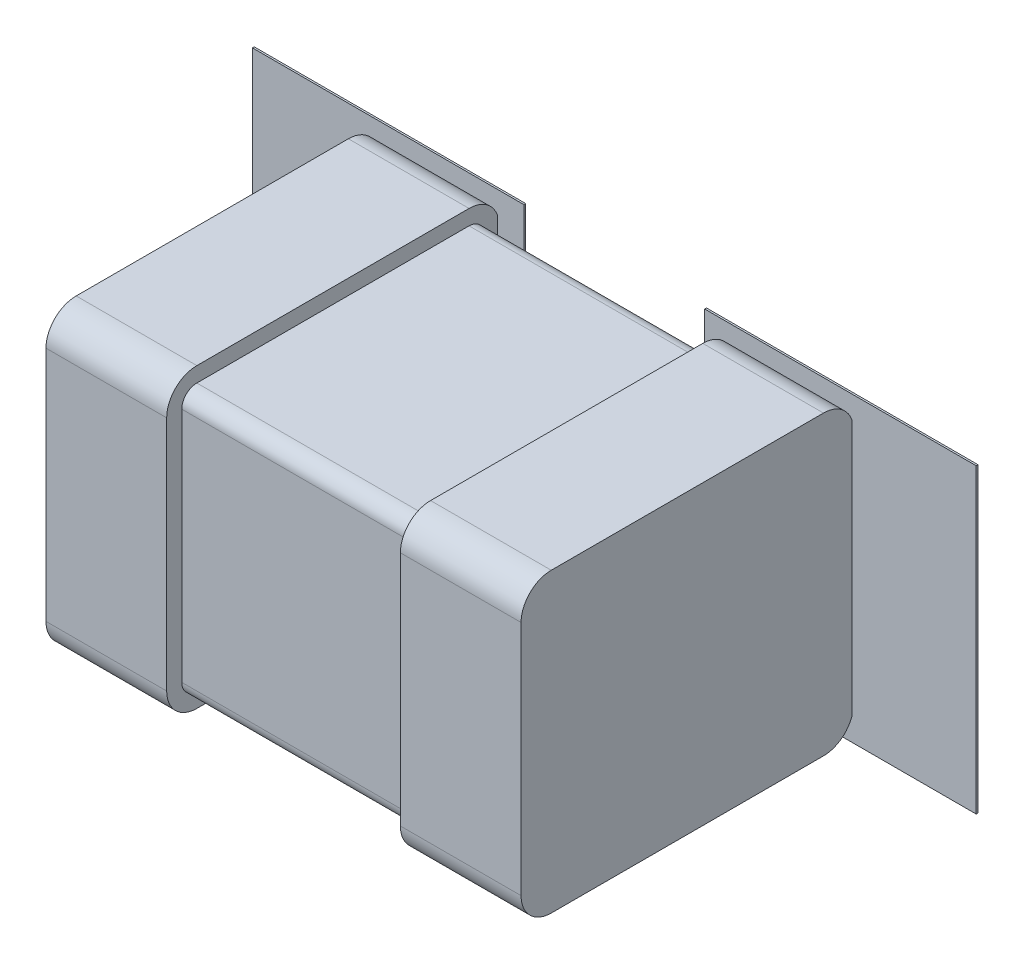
ISO-10303-21;
HEADER;
FILE_DESCRIPTION(('STEP AP214'),'2;1');
FILE_NAME('part.step','',(''),(''),'','','');
FILE_SCHEMA(('AUTOMOTIVE_DESIGN { 1 0 10303 214 1 1 1 1 }'));
ENDSEC;
DATA;
#1=APPLICATION_CONTEXT('core data for automotive mechanical design processes');
#2=APPLICATION_PROTOCOL_DEFINITION('international standard','automotive_design',2000,#1);
#3=PRODUCT_CONTEXT('',#1,'mechanical');
#4=PRODUCT('Part','Part','',(#3));
#5=PRODUCT_RELATED_PRODUCT_CATEGORY('part','',(#4));
#6=PRODUCT_DEFINITION_FORMATION('','',#4);
#7=PRODUCT_DEFINITION_CONTEXT('part definition',#1,'design');
#8=PRODUCT_DEFINITION('design','',#6,#7);
#9=PRODUCT_DEFINITION_SHAPE('','',#8);
#10=(LENGTH_UNIT() NAMED_UNIT(*) SI_UNIT(.MILLI.,.METRE.));
#11=(NAMED_UNIT(*) PLANE_ANGLE_UNIT() SI_UNIT($,.RADIAN.));
#12=(NAMED_UNIT(*) SI_UNIT($,.STERADIAN.) SOLID_ANGLE_UNIT());
#13=UNCERTAINTY_MEASURE_WITH_UNIT(LENGTH_MEASURE(1.E-05),#10,'distance_accuracy_value','');
#14=(GEOMETRIC_REPRESENTATION_CONTEXT(3) GLOBAL_UNCERTAINTY_ASSIGNED_CONTEXT((#13)) GLOBAL_UNIT_ASSIGNED_CONTEXT((#10,
#11,#12)) REPRESENTATION_CONTEXT('',''));
#15=CARTESIAN_POINT('',(0.,0.,0.));
#16=DIRECTION('',(0.,0.,1.));
#17=DIRECTION('',(1.,0.,0.));
#18=AXIS2_PLACEMENT_3D('',#15,#16,#17);
#19=CARTESIAN_POINT('',(0.,0.,0.0762));
#20=DIRECTION('',(0.,0.,1.));
#21=DIRECTION('',(1.,0.,0.));
#22=AXIS2_PLACEMENT_3D('',#19,#20,#21);
#23=PLANE('',#22);
#24=DIRECTION('',(0.,1.,0.));
#25=VECTOR('',#24,1.);
#26=CARTESIAN_POINT('',(0.380492,0.635,0.0762));
#27=LINE('',#26,#25);
#28=CARTESIAN_POINT('',(0.380492,0.635,0.0762));
#29=VERTEX_POINT('',#28);
#30=CARTESIAN_POINT('',(0.380492,-0.635,0.0762));
#31=VERTEX_POINT('',#30);
#32=EDGE_CURVE('E228',#29,#31,#27,.F.);
#33=ORIENTED_EDGE('',*,*,#32,.F.);
#34=DIRECTION('',(1.,0.,0.));
#35=VECTOR('',#34,1.);
#36=CARTESIAN_POINT('',(1.523492,0.635,0.0762));
#37=LINE('',#36,#35);
#38=CARTESIAN_POINT('',(1.523492,0.635,0.0762));
#39=VERTEX_POINT('',#38);
#40=EDGE_CURVE('E215',#39,#29,#37,.F.);
#41=ORIENTED_EDGE('',*,*,#40,.F.);
#42=DIRECTION('',(0.,1.,0.));
#43=VECTOR('',#42,1.);
#44=CARTESIAN_POINT('',(1.523492,-0.635,0.0762));
#45=LINE('',#44,#43);
#46=CARTESIAN_POINT('',(1.523492,-0.635,0.0762));
#47=VERTEX_POINT('',#46);
#48=EDGE_CURVE('E356',#47,#39,#45,.T.);
#49=ORIENTED_EDGE('',*,*,#48,.F.);
#50=DIRECTION('',(1.,0.,0.));
#51=VECTOR('',#50,1.);
#52=CARTESIAN_POINT('',(0.380492,-0.635,0.0762));
#53=LINE('',#52,#51);
#54=EDGE_CURVE('E229',#31,#47,#53,.T.);
#55=ORIENTED_EDGE('',*,*,#54,.F.);
#56=EDGE_LOOP('',(#33,#41,#49,#55));
#57=FACE_BOUND('',#56,.T.);
#58=ADVANCED_FACE('F16',(#57),#23,.F.);
#59=CARTESIAN_POINT('',(1.523492,0.635,0.0762));
#60=DIRECTION('',(0.,1.,0.));
#61=DIRECTION('',(0.,0.,1.));
#62=AXIS2_PLACEMENT_3D('',#59,#60,#61);
#63=PLANE('',#62);
#64=DIRECTION('',(0.,0.,-1.));
#65=VECTOR('',#64,1.);
#66=CARTESIAN_POINT('',(1.523492,0.635,0.0762));
#67=LINE('',#66,#65);
#68=CARTESIAN_POINT('',(1.523492,0.635,0.08382));
#69=VERTEX_POINT('',#68);
#70=EDGE_CURVE('E222',#39,#69,#67,.F.);
#71=ORIENTED_EDGE('',*,*,#70,.F.);
#72=ORIENTED_EDGE('',*,*,#40,.T.);
#73=DIRECTION('',(0.,0.,1.));
#74=VECTOR('',#73,1.);
#75=CARTESIAN_POINT('',(0.380492,0.635,0.0762));
#76=LINE('',#75,#74);
#77=CARTESIAN_POINT('',(0.380492,0.635,0.08382));
#78=VERTEX_POINT('',#77);
#79=EDGE_CURVE('E219',#78,#29,#76,.F.);
#80=ORIENTED_EDGE('',*,*,#79,.F.);
#81=DIRECTION('',(1.,0.,0.));
#82=VECTOR('',#81,1.);
#83=CARTESIAN_POINT('',(0.,0.635,0.08382));
#84=LINE('',#83,#82);
#85=EDGE_CURVE('E354',#69,#78,#84,.F.);
#86=ORIENTED_EDGE('',*,*,#85,.F.);
#87=EDGE_LOOP('',(#71,#72,#80,#86));
#88=FACE_BOUND('',#87,.T.);
#89=ADVANCED_FACE('F217',(#88),#63,.T.);
#90=CARTESIAN_POINT('',(0.380492,0.635,0.0762));
#91=DIRECTION('',(-1.,0.,0.));
#92=DIRECTION('',(0.,0.,1.));
#93=AXIS2_PLACEMENT_3D('',#90,#91,#92);
#94=PLANE('',#93);
#95=ORIENTED_EDGE('',*,*,#79,.T.);
#96=ORIENTED_EDGE('',*,*,#32,.T.);
#97=DIRECTION('',(0.,0.,-1.));
#98=VECTOR('',#97,1.);
#99=CARTESIAN_POINT('',(0.380492,-0.635,0.0762));
#100=LINE('',#99,#98);
#101=CARTESIAN_POINT('',(0.380492,-0.635,0.08382));
#102=VERTEX_POINT('',#101);
#103=EDGE_CURVE('E232',#102,#31,#100,.T.);
#104=ORIENTED_EDGE('',*,*,#103,.F.);
#105=DIRECTION('',(0.,1.,0.));
#106=VECTOR('',#105,1.);
#107=CARTESIAN_POINT('',(0.380492,0.,0.08382));
#108=LINE('',#107,#106);
#109=EDGE_CURVE('E236',#78,#102,#108,.F.);
#110=ORIENTED_EDGE('',*,*,#109,.F.);
#111=EDGE_LOOP('',(#95,#96,#104,#110));
#112=FACE_BOUND('',#111,.T.);
#113=ADVANCED_FACE('F234',(#112),#94,.T.);
#114=CARTESIAN_POINT('',(0.380492,-0.635,0.0762));
#115=DIRECTION('',(0.,-1.,0.));
#116=DIRECTION('',(0.,0.,-1.));
#117=AXIS2_PLACEMENT_3D('',#114,#115,#116);
#118=PLANE('',#117);
#119=ORIENTED_EDGE('',*,*,#103,.T.);
#120=ORIENTED_EDGE('',*,*,#54,.T.);
#121=DIRECTION('',(0.,0.,-1.));
#122=VECTOR('',#121,1.);
#123=CARTESIAN_POINT('',(1.523492,-0.635,0.0762));
#124=LINE('',#123,#122);
#125=CARTESIAN_POINT('',(1.523492,-0.635,0.08382));
#126=VERTEX_POINT('',#125);
#127=EDGE_CURVE('E191',#126,#47,#124,.T.);
#128=ORIENTED_EDGE('',*,*,#127,.F.);
#129=DIRECTION('',(1.,0.,0.));
#130=VECTOR('',#129,1.);
#131=CARTESIAN_POINT('',(0.,-0.635,0.08382));
#132=LINE('',#131,#130);
#133=EDGE_CURVE('E350',#102,#126,#132,.T.);
#134=ORIENTED_EDGE('',*,*,#133,.F.);
#135=EDGE_LOOP('',(#119,#120,#128,#134));
#136=FACE_BOUND('',#135,.T.);
#137=ADVANCED_FACE('F367',(#136),#118,.T.);
#138=CARTESIAN_POINT('',(1.523492,-0.635,0.0762));
#139=DIRECTION('',(1.,0.,0.));
#140=DIRECTION('',(0.,0.,-1.));
#141=AXIS2_PLACEMENT_3D('',#138,#139,#140);
#142=PLANE('',#141);
#143=ORIENTED_EDGE('',*,*,#127,.T.);
#144=ORIENTED_EDGE('',*,*,#48,.T.);
#145=ORIENTED_EDGE('',*,*,#70,.T.);
#146=DIRECTION('',(0.,1.,0.));
#147=VECTOR('',#146,1.);
#148=CARTESIAN_POINT('',(1.523492,0.,0.08382));
#149=LINE('',#148,#147);
#150=EDGE_CURVE('E347',#126,#69,#149,.T.);
#151=ORIENTED_EDGE('',*,*,#150,.F.);
#152=EDGE_LOOP('',(#143,#144,#145,#151));
#153=FACE_BOUND('',#152,.T.);
#154=ADVANCED_FACE('F371',(#153),#142,.T.);
#155=CARTESIAN_POINT('',(1.00000000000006,-0.62500000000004,0.0762));
#156=DIRECTION('',(1.,0.,0.));
#157=DIRECTION('',(0.,0.,-1.));
#158=AXIS2_PLACEMENT_3D('',#155,#156,#157);
#159=PLANE('',#158);
#160=CARTESIAN_POINT('',(1.00000000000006,-0.49800000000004,0.2032));
#161=DIRECTION('',(1.,0.,0.));
#162=DIRECTION('',(0.,0.,-1.));
#163=AXIS2_PLACEMENT_3D('',#160,#161,#162);
#164=CIRCLE('',#163,0.127);
#165=CARTESIAN_POINT('',(1.00000000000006,-0.541329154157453,0.083819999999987));
#166=VERTEX_POINT('',#165);
#167=CARTESIAN_POINT('',(1.00000000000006,-0.62500000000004,0.2032));
#168=VERTEX_POINT('',#167);
#169=EDGE_CURVE('E318',#166,#168,#164,.F.);
#170=ORIENTED_EDGE('',*,*,#169,.F.);
#171=DIRECTION('',(0.,1.,0.));
#172=VECTOR('',#171,1.);
#173=CARTESIAN_POINT('',(1.00000000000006,0.,0.08382));
#174=LINE('',#173,#172);
#175=CARTESIAN_POINT('',(1.00000000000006,0.541329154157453,0.083819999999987));
#176=VERTEX_POINT('',#175);
#177=EDGE_CURVE('E182',#176,#166,#174,.F.);
#178=ORIENTED_EDGE('',*,*,#177,.F.);
#179=CARTESIAN_POINT('',(1.00000000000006,0.49800000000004,0.2032));
#180=DIRECTION('',(1.,0.,0.));
#181=DIRECTION('',(0.,0.,-1.));
#182=AXIS2_PLACEMENT_3D('',#179,#180,#181);
#183=CIRCLE('',#182,0.127);
#184=CARTESIAN_POINT('',(1.00000000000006,0.62500000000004,0.2032));
#185=VERTEX_POINT('',#184);
#186=EDGE_CURVE('E19',#185,#176,#183,.F.);
#187=ORIENTED_EDGE('',*,*,#186,.F.);
#188=DIRECTION('',(0.,0.,1.));
#189=VECTOR('',#188,1.);
#190=CARTESIAN_POINT('',(1.00000000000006,0.62500000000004,0.0762));
#191=LINE('',#190,#189);
#192=CARTESIAN_POINT('',(1.00000000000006,0.62500000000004,1.349248));
#193=VERTEX_POINT('',#192);
#194=EDGE_CURVE('E336',#193,#185,#191,.F.);
#195=ORIENTED_EDGE('',*,*,#194,.F.);
#196=CARTESIAN_POINT('',(1.00000000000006,0.49800000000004,1.349248));
#197=DIRECTION('',(-1.,0.,0.));
#198=DIRECTION('',(0.,0.,1.));
#199=AXIS2_PLACEMENT_3D('',#196,#197,#198);
#200=CIRCLE('',#199,0.127);
#201=CARTESIAN_POINT('',(1.00000000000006,0.49800000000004,1.476248));
#202=VERTEX_POINT('',#201);
#203=EDGE_CURVE('E326',#202,#193,#200,.T.);
#204=ORIENTED_EDGE('',*,*,#203,.F.);
#205=DIRECTION('',(0.,1.,0.));
#206=VECTOR('',#205,1.);
#207=CARTESIAN_POINT('',(1.00000000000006,0.,1.476248));
#208=LINE('',#207,#206);
#209=CARTESIAN_POINT('',(1.00000000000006,-0.49800000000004,1.476248));
#210=VERTEX_POINT('',#209);
#211=EDGE_CURVE('E333',#210,#202,#208,.T.);
#212=ORIENTED_EDGE('',*,*,#211,.F.);
#213=CARTESIAN_POINT('',(1.00000000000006,-0.49800000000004,1.349248));
#214=DIRECTION('',(1.,0.,0.));
#215=DIRECTION('',(0.,0.,-1.));
#216=AXIS2_PLACEMENT_3D('',#213,#214,#215);
#217=CIRCLE('',#216,0.127);
#218=CARTESIAN_POINT('',(1.00000000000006,-0.62500000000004,1.349248));
#219=VERTEX_POINT('',#218);
#220=EDGE_CURVE('E322',#219,#210,#217,.F.);
#221=ORIENTED_EDGE('',*,*,#220,.F.);
#222=DIRECTION('',(0.,0.,-1.));
#223=VECTOR('',#222,1.);
#224=CARTESIAN_POINT('',(1.00000000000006,-0.62500000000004,0.0762));
#225=LINE('',#224,#223);
#226=EDGE_CURVE('E324',#168,#219,#225,.F.);
#227=ORIENTED_EDGE('',*,*,#226,.F.);
#228=EDGE_LOOP('',(#170,#178,#187,#195,#204,#212,#221,#227));
#229=FACE_BOUND('',#228,.T.);
#230=ADVANCED_FACE('F373',(#229),#159,.T.);
#231=CARTESIAN_POINT('',(0.,0.,0.08382));
#232=DIRECTION('',(0.,0.,1.));
#233=DIRECTION('',(1.,0.,0.));
#234=AXIS2_PLACEMENT_3D('',#231,#232,#233);
#235=PLANE('',#234);
#236=DIRECTION('',(1.,0.,0.));
#237=VECTOR('',#236,1.);
#238=CARTESIAN_POINT('',(1.00000000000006,0.541329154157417,0.083819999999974));
#239=LINE('',#238,#237);
#240=CARTESIAN_POINT('',(0.492000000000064,0.541329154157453,0.083819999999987));
#241=VERTEX_POINT('',#240);
#242=EDGE_CURVE('E344',#176,#241,#239,.F.);
#243=ORIENTED_EDGE('',*,*,#242,.F.);
#244=ORIENTED_EDGE('',*,*,#177,.T.);
#245=DIRECTION('',(1.,0.,0.));
#246=VECTOR('',#245,1.);
#247=CARTESIAN_POINT('',(1.00000000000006,-0.541329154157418,0.083819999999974));
#248=LINE('',#247,#246);
#249=CARTESIAN_POINT('',(0.492000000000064,-0.541329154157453,0.083819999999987));
#250=VERTEX_POINT('',#249);
#251=EDGE_CURVE('E321',#250,#166,#248,.T.);
#252=ORIENTED_EDGE('',*,*,#251,.F.);
#253=DIRECTION('',(0.,1.,0.));
#254=VECTOR('',#253,1.);
#255=CARTESIAN_POINT('',(0.492000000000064,0.56150000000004,0.0838200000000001));
#256=LINE('',#255,#254);
#257=EDGE_CURVE('E317',#250,#241,#256,.T.);
#258=ORIENTED_EDGE('',*,*,#257,.T.);
#259=EDGE_LOOP('',(#243,#244,#252,#258));
#260=FACE_BOUND('',#259,.T.);
#261=ORIENTED_EDGE('',*,*,#133,.T.);
#262=ORIENTED_EDGE('',*,*,#150,.T.);
#263=ORIENTED_EDGE('',*,*,#85,.T.);
#264=ORIENTED_EDGE('',*,*,#109,.T.);
#265=EDGE_LOOP('',(#261,#262,#263,#264));
#266=FACE_BOUND('',#265,.T.);
#267=ADVANCED_FACE('F369',(#260,#266),#235,.T.);
#268=CARTESIAN_POINT('',(1.00000000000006,0.49800000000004,0.2032));
#269=DIRECTION('',(1.,0.,0.));
#270=DIRECTION('',(0.,0.,-1.));
#271=AXIS2_PLACEMENT_3D('',#268,#269,#270);
#272=CYLINDRICAL_SURFACE('',#271,0.127);
#273=DIRECTION('',(1.,0.,0.));
#274=VECTOR('',#273,1.);
#275=CARTESIAN_POINT('',(1.00000000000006,0.62500000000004,0.2032));
#276=LINE('',#275,#274);
#277=CARTESIAN_POINT('',(0.492000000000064,0.62500000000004,0.2032));
#278=VERTEX_POINT('',#277);
#279=EDGE_CURVE('E329',#185,#278,#276,.F.);
#280=ORIENTED_EDGE('',*,*,#279,.F.);
#281=ORIENTED_EDGE('',*,*,#186,.T.);
#282=ORIENTED_EDGE('',*,*,#242,.T.);
#283=CARTESIAN_POINT('',(0.492000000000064,0.49800000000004,0.2032));
#284=DIRECTION('',(1.,0.,0.));
#285=DIRECTION('',(0.,0.,-1.));
#286=AXIS2_PLACEMENT_3D('',#283,#284,#285);
#287=CIRCLE('',#286,0.127);
#288=EDGE_CURVE('E315',#241,#278,#287,.T.);
#289=ORIENTED_EDGE('',*,*,#288,.T.);
#290=EDGE_LOOP('',(#280,#281,#282,#289));
#291=FACE_BOUND('',#290,.T.);
#292=ADVANCED_FACE('F502',(#291),#272,.T.);
#293=CARTESIAN_POINT('',(1.00000000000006,0.62500000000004,0.0762));
#294=DIRECTION('',(0.,1.,0.));
#295=DIRECTION('',(0.,0.,1.));
#296=AXIS2_PLACEMENT_3D('',#293,#294,#295);
#297=PLANE('',#296);
#298=ORIENTED_EDGE('',*,*,#194,.T.);
#299=ORIENTED_EDGE('',*,*,#279,.T.);
#300=DIRECTION('',(0.,0.,-1.));
#301=VECTOR('',#300,1.);
#302=CARTESIAN_POINT('',(0.492000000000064,0.62500000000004,1.476248));
#303=LINE('',#302,#301);
#304=CARTESIAN_POINT('',(0.492000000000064,0.62500000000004,1.349248));
#305=VERTEX_POINT('',#304);
#306=EDGE_CURVE('E314',#278,#305,#303,.F.);
#307=ORIENTED_EDGE('',*,*,#306,.T.);
#308=DIRECTION('',(-1.,0.,0.));
#309=VECTOR('',#308,1.);
#310=CARTESIAN_POINT('',(1.00534543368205,0.62500000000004,1.349248));
#311=LINE('',#310,#309);
#312=EDGE_CURVE('E328',#193,#305,#311,.T.);
#313=ORIENTED_EDGE('',*,*,#312,.F.);
#314=EDGE_LOOP('',(#298,#299,#307,#313));
#315=FACE_BOUND('',#314,.T.);
#316=ADVANCED_FACE('F499',(#315),#297,.T.);
#317=CARTESIAN_POINT('',(1.00534543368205,0.49800000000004,1.349248));
#318=DIRECTION('',(-1.,0.,0.));
#319=DIRECTION('',(0.,0.,1.));
#320=AXIS2_PLACEMENT_3D('',#317,#318,#319);
#321=CYLINDRICAL_SURFACE('',#320,0.127);
#322=ORIENTED_EDGE('',*,*,#312,.T.);
#323=CARTESIAN_POINT('',(0.492000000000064,0.49800000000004,1.349248));
#324=DIRECTION('',(-1.,0.,0.));
#325=DIRECTION('',(0.,0.,1.));
#326=AXIS2_PLACEMENT_3D('',#323,#324,#325);
#327=CIRCLE('',#326,0.127);
#328=CARTESIAN_POINT('',(0.492000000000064,0.49800000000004,1.476248));
#329=VERTEX_POINT('',#328);
#330=EDGE_CURVE('E312',#305,#329,#327,.F.);
#331=ORIENTED_EDGE('',*,*,#330,.T.);
#332=DIRECTION('',(1.,0.,0.));
#333=VECTOR('',#332,1.);
#334=CARTESIAN_POINT('',(0.,0.49800000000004,1.476248));
#335=LINE('',#334,#333);
#336=EDGE_CURVE('E362',#202,#329,#335,.F.);
#337=ORIENTED_EDGE('',*,*,#336,.F.);
#338=ORIENTED_EDGE('',*,*,#203,.T.);
#339=EDGE_LOOP('',(#322,#331,#337,#338));
#340=FACE_BOUND('',#339,.T.);
#341=ADVANCED_FACE('F495',(#340),#321,.T.);
#342=CARTESIAN_POINT('',(0.,0.,1.476248));
#343=DIRECTION('',(0.,0.,1.));
#344=DIRECTION('',(1.,0.,0.));
#345=AXIS2_PLACEMENT_3D('',#342,#343,#344);
#346=PLANE('',#345);
#347=ORIENTED_EDGE('',*,*,#211,.T.);
#348=ORIENTED_EDGE('',*,*,#336,.T.);
#349=DIRECTION('',(0.,1.,0.));
#350=VECTOR('',#349,1.);
#351=CARTESIAN_POINT('',(0.492000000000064,0.56150000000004,1.476248));
#352=LINE('',#351,#350);
#353=CARTESIAN_POINT('',(0.492000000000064,-0.49800000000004,1.476248));
#354=VERTEX_POINT('',#353);
#355=EDGE_CURVE('E311',#329,#354,#352,.F.);
#356=ORIENTED_EDGE('',*,*,#355,.T.);
#357=DIRECTION('',(1.,0.,0.));
#358=VECTOR('',#357,1.);
#359=CARTESIAN_POINT('',(-1.00555932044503,-0.49800000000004,1.476248));
#360=LINE('',#359,#358);
#361=EDGE_CURVE('E325',#210,#354,#360,.F.);
#362=ORIENTED_EDGE('',*,*,#361,.F.);
#363=EDGE_LOOP('',(#347,#348,#356,#362));
#364=FACE_BOUND('',#363,.T.);
#365=ADVANCED_FACE('F491',(#364),#346,.T.);
#366=CARTESIAN_POINT('',(-1.00555932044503,-0.49800000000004,1.349248));
#367=DIRECTION('',(1.,0.,0.));
#368=DIRECTION('',(0.,0.,-1.));
#369=AXIS2_PLACEMENT_3D('',#366,#367,#368);
#370=CYLINDRICAL_SURFACE('',#369,0.127);
#371=DIRECTION('',(1.,0.,0.));
#372=VECTOR('',#371,1.);
#373=CARTESIAN_POINT('',(-1.00000000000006,-0.62500000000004,1.349248));
#374=LINE('',#373,#372);
#375=CARTESIAN_POINT('',(0.492000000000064,-0.62500000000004,1.349248));
#376=VERTEX_POINT('',#375);
#377=EDGE_CURVE('E360',#219,#376,#374,.F.);
#378=ORIENTED_EDGE('',*,*,#377,.F.);
#379=ORIENTED_EDGE('',*,*,#220,.T.);
#380=ORIENTED_EDGE('',*,*,#361,.T.);
#381=CARTESIAN_POINT('',(0.492000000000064,-0.49800000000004,1.349248));
#382=DIRECTION('',(1.,0.,0.));
#383=DIRECTION('',(0.,0.,-1.));
#384=AXIS2_PLACEMENT_3D('',#381,#382,#383);
#385=CIRCLE('',#384,0.127);
#386=EDGE_CURVE('E309',#354,#376,#385,.T.);
#387=ORIENTED_EDGE('',*,*,#386,.T.);
#388=EDGE_LOOP('',(#378,#379,#380,#387));
#389=FACE_BOUND('',#388,.T.);
#390=ADVANCED_FACE('F487',(#389),#370,.T.);
#391=CARTESIAN_POINT('',(-1.00000000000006,-0.62500000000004,0.0762));
#392=DIRECTION('',(0.,-1.,0.));
#393=DIRECTION('',(0.,0.,-1.));
#394=AXIS2_PLACEMENT_3D('',#391,#392,#393);
#395=PLANE('',#394);
#396=DIRECTION('',(0.,0.,-1.));
#397=VECTOR('',#396,1.);
#398=CARTESIAN_POINT('',(0.492000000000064,-0.62500000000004,1.476248));
#399=LINE('',#398,#397);
#400=CARTESIAN_POINT('',(0.492000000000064,-0.62500000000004,0.2032));
#401=VERTEX_POINT('',#400);
#402=EDGE_CURVE('E308',#376,#401,#399,.T.);
#403=ORIENTED_EDGE('',*,*,#402,.T.);
#404=DIRECTION('',(1.,0.,0.));
#405=VECTOR('',#404,1.);
#406=CARTESIAN_POINT('',(1.00000000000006,-0.62500000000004,0.2032));
#407=LINE('',#406,#405);
#408=EDGE_CURVE('E525',#168,#401,#407,.F.);
#409=ORIENTED_EDGE('',*,*,#408,.F.);
#410=ORIENTED_EDGE('',*,*,#226,.T.);
#411=ORIENTED_EDGE('',*,*,#377,.T.);
#412=EDGE_LOOP('',(#403,#409,#410,#411));
#413=FACE_BOUND('',#412,.T.);
#414=ADVANCED_FACE('F483',(#413),#395,.T.);
#415=CARTESIAN_POINT('',(1.00000000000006,-0.49800000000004,0.2032));
#416=DIRECTION('',(1.,0.,0.));
#417=DIRECTION('',(0.,0.,-1.));
#418=AXIS2_PLACEMENT_3D('',#415,#416,#417);
#419=CYLINDRICAL_SURFACE('',#418,0.127);
#420=ORIENTED_EDGE('',*,*,#251,.T.);
#421=ORIENTED_EDGE('',*,*,#169,.T.);
#422=ORIENTED_EDGE('',*,*,#408,.T.);
#423=CARTESIAN_POINT('',(0.492000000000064,-0.49800000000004,0.2032));
#424=DIRECTION('',(1.,0.,0.));
#425=DIRECTION('',(0.,0.,-1.));
#426=AXIS2_PLACEMENT_3D('',#423,#424,#425);
#427=CIRCLE('',#426,0.127);
#428=EDGE_CURVE('E305',#401,#250,#427,.T.);
#429=ORIENTED_EDGE('',*,*,#428,.T.);
#430=EDGE_LOOP('',(#420,#421,#422,#429));
#431=FACE_BOUND('',#430,.T.);
#432=ADVANCED_FACE('F479',(#431),#419,.T.);
#433=CARTESIAN_POINT('',(0.492000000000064,0.56150000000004,1.476248));
#434=DIRECTION('',(1.,0.,0.));
#435=DIRECTION('',(0.,0.,-1.));
#436=AXIS2_PLACEMENT_3D('',#433,#434,#435);
#437=PLANE('',#436);
#438=DIRECTION('',(0.,0.,1.));
#439=VECTOR('',#438,1.);
#440=CARTESIAN_POINT('',(0.492000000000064,-0.56150000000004,1.476248));
#441=LINE('',#440,#439);
#442=CARTESIAN_POINT('',(0.492000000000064,-0.56150000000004,1.349248));
#443=VERTEX_POINT('',#442);
#444=CARTESIAN_POINT('',(0.492000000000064,-0.56150000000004,0.2032));
#445=VERTEX_POINT('',#444);
#446=EDGE_CURVE('E294',#443,#445,#441,.F.);
#447=ORIENTED_EDGE('',*,*,#446,.T.);
#448=CARTESIAN_POINT('',(0.492000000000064,-0.49800000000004,0.2032));
#449=DIRECTION('',(1.,0.,0.));
#450=DIRECTION('',(0.,0.,-1.));
#451=AXIS2_PLACEMENT_3D('',#448,#449,#450);
#452=CIRCLE('',#451,0.0635);
#453=CARTESIAN_POINT('',(0.492000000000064,-0.49800000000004,0.1397));
#454=VERTEX_POINT('',#453);
#455=EDGE_CURVE('E290',#454,#445,#452,.F.);
#456=ORIENTED_EDGE('',*,*,#455,.F.);
#457=DIRECTION('',(0.,1.,0.));
#458=VECTOR('',#457,1.);
#459=CARTESIAN_POINT('',(0.492000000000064,0.56150000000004,0.1397));
#460=LINE('',#459,#458);
#461=CARTESIAN_POINT('',(0.492000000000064,0.49800000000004,0.1397));
#462=VERTEX_POINT('',#461);
#463=EDGE_CURVE('E536',#454,#462,#460,.T.);
#464=ORIENTED_EDGE('',*,*,#463,.T.);
#465=CARTESIAN_POINT('',(0.492000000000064,0.49800000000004,0.2032));
#466=DIRECTION('',(-1.,0.,0.));
#467=DIRECTION('',(0.,0.,1.));
#468=AXIS2_PLACEMENT_3D('',#465,#466,#467);
#469=CIRCLE('',#468,0.0635);
#470=CARTESIAN_POINT('',(0.492000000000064,0.56150000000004,0.2032));
#471=VERTEX_POINT('',#470);
#472=EDGE_CURVE('E285',#471,#462,#469,.T.);
#473=ORIENTED_EDGE('',*,*,#472,.F.);
#474=DIRECTION('',(0.,0.,-1.));
#475=VECTOR('',#474,1.);
#476=CARTESIAN_POINT('',(0.492000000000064,0.56150000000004,1.476248));
#477=LINE('',#476,#475);
#478=CARTESIAN_POINT('',(0.492000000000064,0.56150000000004,1.349248));
#479=VERTEX_POINT('',#478);
#480=EDGE_CURVE('E304',#471,#479,#477,.F.);
#481=ORIENTED_EDGE('',*,*,#480,.T.);
#482=CARTESIAN_POINT('',(0.492000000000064,0.49800000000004,1.349248));
#483=DIRECTION('',(1.,0.,0.));
#484=DIRECTION('',(0.,0.,-1.));
#485=AXIS2_PLACEMENT_3D('',#482,#483,#484);
#486=CIRCLE('',#485,0.0635);
#487=CARTESIAN_POINT('',(0.492000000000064,0.49800000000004,1.412748));
#488=VERTEX_POINT('',#487);
#489=EDGE_CURVE('E300',#488,#479,#486,.F.);
#490=ORIENTED_EDGE('',*,*,#489,.F.);
#491=DIRECTION('',(0.,1.,0.));
#492=VECTOR('',#491,1.);
#493=CARTESIAN_POINT('',(0.492000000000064,0.56150000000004,1.412748));
#494=LINE('',#493,#492);
#495=CARTESIAN_POINT('',(0.492000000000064,-0.49800000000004,1.412748));
#496=VERTEX_POINT('',#495);
#497=EDGE_CURVE('E299',#488,#496,#494,.F.);
#498=ORIENTED_EDGE('',*,*,#497,.T.);
#499=CARTESIAN_POINT('',(0.492000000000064,-0.49800000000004,1.349248));
#500=DIRECTION('',(-1.,0.,0.));
#501=DIRECTION('',(0.,0.,1.));
#502=AXIS2_PLACEMENT_3D('',#499,#500,#501);
#503=CIRCLE('',#502,0.0635);
#504=EDGE_CURVE('E295',#443,#496,#503,.T.);
#505=ORIENTED_EDGE('',*,*,#504,.F.);
#506=EDGE_LOOP('',(#447,#456,#464,#473,#481,#490,#498,#505));
#507=FACE_BOUND('',#506,.T.);
#508=ORIENTED_EDGE('',*,*,#402,.F.);
#509=ORIENTED_EDGE('',*,*,#386,.F.);
#510=ORIENTED_EDGE('',*,*,#355,.F.);
#511=ORIENTED_EDGE('',*,*,#330,.F.);
#512=ORIENTED_EDGE('',*,*,#306,.F.);
#513=ORIENTED_EDGE('',*,*,#288,.F.);
#514=ORIENTED_EDGE('',*,*,#257,.F.);
#515=ORIENTED_EDGE('',*,*,#428,.F.);
#516=EDGE_LOOP('',(#508,#509,#510,#511,#512,#513,#514,#515));
#517=FACE_BOUND('',#516,.T.);
#518=ADVANCED_FACE('F475',(#507,#517),#437,.F.);
#519=CARTESIAN_POINT('',(0.,0.,0.0762));
#520=DIRECTION('',(0.,0.,1.));
#521=DIRECTION('',(1.,0.,0.));
#522=AXIS2_PLACEMENT_3D('',#519,#520,#521);
#523=PLANE('',#522);
#524=DIRECTION('',(0.,1.,0.));
#525=VECTOR('',#524,1.);
#526=CARTESIAN_POINT('',(-0.380492,-0.635,0.0762));
#527=LINE('',#526,#525);
#528=CARTESIAN_POINT('',(-0.380492,-0.635,0.0762));
#529=VERTEX_POINT('',#528);
#530=CARTESIAN_POINT('',(-0.380492,0.635,0.0762));
#531=VERTEX_POINT('',#530);
#532=EDGE_CURVE('E576',#529,#531,#527,.T.);
#533=ORIENTED_EDGE('',*,*,#532,.F.);
#534=DIRECTION('',(1.,0.,0.));
#535=VECTOR('',#534,1.);
#536=CARTESIAN_POINT('',(-1.523492,-0.635,0.0762));
#537=LINE('',#536,#535);
#538=CARTESIAN_POINT('',(-1.523492,-0.635,0.0762));
#539=VERTEX_POINT('',#538);
#540=EDGE_CURVE('E564',#539,#529,#537,.T.);
#541=ORIENTED_EDGE('',*,*,#540,.F.);
#542=DIRECTION('',(0.,1.,0.));
#543=VECTOR('',#542,1.);
#544=CARTESIAN_POINT('',(-1.523492,0.635,0.0762));
#545=LINE('',#544,#543);
#546=CARTESIAN_POINT('',(-1.523492,0.635,0.0762));
#547=VERTEX_POINT('',#546);
#548=EDGE_CURVE('E591',#547,#539,#545,.F.);
#549=ORIENTED_EDGE('',*,*,#548,.F.);
#550=DIRECTION('',(1.,0.,0.));
#551=VECTOR('',#550,1.);
#552=CARTESIAN_POINT('',(-0.380492,0.635,0.0762));
#553=LINE('',#552,#551);
#554=EDGE_CURVE('E582',#531,#547,#553,.F.);
#555=ORIENTED_EDGE('',*,*,#554,.F.);
#556=EDGE_LOOP('',(#533,#541,#549,#555));
#557=FACE_BOUND('',#556,.T.);
#558=ADVANCED_FACE('F471',(#557),#523,.F.);
#559=CARTESIAN_POINT('',(-0.492000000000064,0.56150000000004,1.476248));
#560=DIRECTION('',(0.,-1.,0.));
#561=DIRECTION('',(0.,0.,-1.));
#562=AXIS2_PLACEMENT_3D('',#559,#560,#561);
#563=PLANE('',#562);
#564=DIRECTION('',(1.,0.,0.));
#565=VECTOR('',#564,1.);
#566=CARTESIAN_POINT('',(-0.49782743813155,0.56150000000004,1.349248));
#567=LINE('',#566,#565);
#568=CARTESIAN_POINT('',(-0.492000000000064,0.56150000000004,1.349248));
#569=VERTEX_POINT('',#568);
#570=EDGE_CURVE('E303',#479,#569,#567,.F.);
#571=ORIENTED_EDGE('',*,*,#570,.F.);
#572=ORIENTED_EDGE('',*,*,#480,.F.);
#573=DIRECTION('',(-1.,0.,0.));
#574=VECTOR('',#573,1.);
#575=CARTESIAN_POINT('',(0.497345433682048,0.56150000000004,0.2032));
#576=LINE('',#575,#574);
#577=CARTESIAN_POINT('',(-0.492000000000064,0.56150000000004,0.2032));
#578=VERTEX_POINT('',#577);
#579=EDGE_CURVE('E289',#578,#471,#576,.F.);
#580=ORIENTED_EDGE('',*,*,#579,.F.);
#581=DIRECTION('',(0.,0.,1.));
#582=VECTOR('',#581,1.);
#583=CARTESIAN_POINT('',(-0.492000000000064,0.56150000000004,1.476248));
#584=LINE('',#583,#582);
#585=EDGE_CURVE('E284',#578,#569,#584,.T.);
#586=ORIENTED_EDGE('',*,*,#585,.T.);
#587=EDGE_LOOP('',(#571,#572,#580,#586));
#588=FACE_BOUND('',#587,.T.);
#589=ADVANCED_FACE('F467',(#588),#563,.F.);
#590=CARTESIAN_POINT('',(-0.49782743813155,0.49800000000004,1.349248));
#591=DIRECTION('',(1.,0.,0.));
#592=DIRECTION('',(0.,0.,-1.));
#593=AXIS2_PLACEMENT_3D('',#590,#591,#592);
#594=CYLINDRICAL_SURFACE('',#593,0.0635);
#595=CARTESIAN_POINT('',(-0.492000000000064,0.49800000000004,1.349248));
#596=DIRECTION('',(1.,0.,0.));
#597=DIRECTION('',(0.,0.,-1.));
#598=AXIS2_PLACEMENT_3D('',#595,#596,#597);
#599=CIRCLE('',#598,0.0635);
#600=CARTESIAN_POINT('',(-0.492000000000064,0.49800000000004,1.412748));
#601=VERTEX_POINT('',#600);
#602=EDGE_CURVE('E282',#569,#601,#599,.T.);
#603=ORIENTED_EDGE('',*,*,#602,.T.);
#604=DIRECTION('',(-1.,0.,0.));
#605=VECTOR('',#604,1.);
#606=CARTESIAN_POINT('',(0.492000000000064,0.49800000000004,1.412748));
#607=LINE('',#606,#605);
#608=EDGE_CURVE('E543',#601,#488,#607,.F.);
#609=ORIENTED_EDGE('',*,*,#608,.T.);
#610=ORIENTED_EDGE('',*,*,#489,.T.);
#611=ORIENTED_EDGE('',*,*,#570,.T.);
#612=EDGE_LOOP('',(#603,#609,#610,#611));
#613=FACE_BOUND('',#612,.T.);
#614=ADVANCED_FACE('F463',(#613),#594,.T.);
#615=CARTESIAN_POINT('',(0.492000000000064,0.56150000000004,1.412748));
#616=DIRECTION('',(0.,0.,-1.));
#617=DIRECTION('',(-1.,0.,0.));
#618=AXIS2_PLACEMENT_3D('',#615,#616,#617);
#619=PLANE('',#618);
#620=DIRECTION('',(-1.,0.,0.));
#621=VECTOR('',#620,1.);
#622=CARTESIAN_POINT('',(0.497559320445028,-0.49800000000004,1.412748));
#623=LINE('',#622,#621);
#624=CARTESIAN_POINT('',(-0.492000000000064,-0.49800000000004,1.412748));
#625=VERTEX_POINT('',#624);
#626=EDGE_CURVE('E298',#496,#625,#623,.T.);
#627=ORIENTED_EDGE('',*,*,#626,.F.);
#628=ORIENTED_EDGE('',*,*,#497,.F.);
#629=ORIENTED_EDGE('',*,*,#608,.F.);
#630=DIRECTION('',(0.,1.,0.));
#631=VECTOR('',#630,1.);
#632=CARTESIAN_POINT('',(-0.492000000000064,0.62500000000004,1.412748));
#633=LINE('',#632,#631);
#634=EDGE_CURVE('E281',#601,#625,#633,.F.);
#635=ORIENTED_EDGE('',*,*,#634,.T.);
#636=EDGE_LOOP('',(#627,#628,#629,#635));
#637=FACE_BOUND('',#636,.T.);
#638=ADVANCED_FACE('F459',(#637),#619,.F.);
#639=CARTESIAN_POINT('',(0.497559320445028,-0.49800000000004,1.349248));
#640=DIRECTION('',(-1.,0.,0.));
#641=DIRECTION('',(0.,0.,1.));
#642=AXIS2_PLACEMENT_3D('',#639,#640,#641);
#643=CYLINDRICAL_SURFACE('',#642,0.0635);
#644=ORIENTED_EDGE('',*,*,#504,.T.);
#645=ORIENTED_EDGE('',*,*,#626,.T.);
#646=CARTESIAN_POINT('',(-0.492000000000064,-0.49800000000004,1.349248));
#647=DIRECTION('',(-1.,0.,0.));
#648=DIRECTION('',(0.,0.,1.));
#649=AXIS2_PLACEMENT_3D('',#646,#647,#648);
#650=CIRCLE('',#649,0.0635);
#651=CARTESIAN_POINT('',(-0.492000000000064,-0.56150000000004,1.349248));
#652=VERTEX_POINT('',#651);
#653=EDGE_CURVE('E279',#625,#652,#650,.F.);
#654=ORIENTED_EDGE('',*,*,#653,.T.);
#655=DIRECTION('',(1.,0.,0.));
#656=VECTOR('',#655,1.);
#657=CARTESIAN_POINT('',(0.492000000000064,-0.56150000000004,1.349248));
#658=LINE('',#657,#656);
#659=EDGE_CURVE('E542',#652,#443,#658,.T.);
#660=ORIENTED_EDGE('',*,*,#659,.T.);
#661=EDGE_LOOP('',(#644,#645,#654,#660));
#662=FACE_BOUND('',#661,.T.);
#663=ADVANCED_FACE('F455',(#662),#643,.T.);
#664=CARTESIAN_POINT('',(0.492000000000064,-0.56150000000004,1.476248));
#665=DIRECTION('',(0.,1.,0.));
#666=DIRECTION('',(0.,0.,1.));
#667=AXIS2_PLACEMENT_3D('',#664,#665,#666);
#668=PLANE('',#667);
#669=DIRECTION('',(1.,0.,0.));
#670=VECTOR('',#669,1.);
#671=CARTESIAN_POINT('',(-0.497345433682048,-0.56150000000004,0.2032));
#672=LINE('',#671,#670);
#673=CARTESIAN_POINT('',(-0.492000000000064,-0.56150000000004,0.2032));
#674=VERTEX_POINT('',#673);
#675=EDGE_CURVE('E293',#445,#674,#672,.F.);
#676=ORIENTED_EDGE('',*,*,#675,.F.);
#677=ORIENTED_EDGE('',*,*,#446,.F.);
#678=ORIENTED_EDGE('',*,*,#659,.F.);
#679=DIRECTION('',(0.,0.,1.));
#680=VECTOR('',#679,1.);
#681=CARTESIAN_POINT('',(-0.492000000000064,-0.56150000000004,1.476248));
#682=LINE('',#681,#680);
#683=EDGE_CURVE('E278',#652,#674,#682,.F.);
#684=ORIENTED_EDGE('',*,*,#683,.T.);
#685=EDGE_LOOP('',(#676,#677,#678,#684));
#686=FACE_BOUND('',#685,.T.);
#687=ADVANCED_FACE('F451',(#686),#668,.F.);
#688=CARTESIAN_POINT('',(-0.497345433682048,-0.49800000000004,0.2032));
#689=DIRECTION('',(1.,0.,0.));
#690=DIRECTION('',(0.,0.,-1.));
#691=AXIS2_PLACEMENT_3D('',#688,#689,#690);
#692=CYLINDRICAL_SURFACE('',#691,0.0635);
#693=CARTESIAN_POINT('',(-0.492000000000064,-0.49800000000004,0.2032));
#694=DIRECTION('',(1.,0.,0.));
#695=DIRECTION('',(0.,0.,-1.));
#696=AXIS2_PLACEMENT_3D('',#693,#694,#695);
#697=CIRCLE('',#696,0.0635);
#698=CARTESIAN_POINT('',(-0.492000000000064,-0.49800000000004,0.1397));
#699=VERTEX_POINT('',#698);
#700=EDGE_CURVE('E276',#674,#699,#697,.T.);
#701=ORIENTED_EDGE('',*,*,#700,.T.);
#702=DIRECTION('',(1.,0.,0.));
#703=VECTOR('',#702,1.);
#704=CARTESIAN_POINT('',(-0.492000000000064,-0.49800000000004,0.1397));
#705=LINE('',#704,#703);
#706=EDGE_CURVE('E557',#699,#454,#705,.T.);
#707=ORIENTED_EDGE('',*,*,#706,.T.);
#708=ORIENTED_EDGE('',*,*,#455,.T.);
#709=ORIENTED_EDGE('',*,*,#675,.T.);
#710=EDGE_LOOP('',(#701,#707,#708,#709));
#711=FACE_BOUND('',#710,.T.);
#712=ADVANCED_FACE('F447',(#711),#692,.T.);
#713=CARTESIAN_POINT('',(-0.492000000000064,0.56150000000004,0.1397));
#714=DIRECTION('',(0.,0.,1.));
#715=DIRECTION('',(1.,0.,0.));
#716=AXIS2_PLACEMENT_3D('',#713,#714,#715);
#717=PLANE('',#716);
#718=ORIENTED_EDGE('',*,*,#706,.F.);
#719=DIRECTION('',(0.,1.,0.));
#720=VECTOR('',#719,1.);
#721=CARTESIAN_POINT('',(-0.492000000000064,0.62500000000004,0.1397));
#722=LINE('',#721,#720);
#723=CARTESIAN_POINT('',(-0.492000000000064,0.49800000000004,0.1397));
#724=VERTEX_POINT('',#723);
#725=EDGE_CURVE('E275',#699,#724,#722,.T.);
#726=ORIENTED_EDGE('',*,*,#725,.T.);
#727=DIRECTION('',(-1.,0.,0.));
#728=VECTOR('',#727,1.);
#729=CARTESIAN_POINT('',(0.497345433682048,0.49800000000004,0.1397));
#730=LINE('',#729,#728);
#731=EDGE_CURVE('E288',#462,#724,#730,.T.);
#732=ORIENTED_EDGE('',*,*,#731,.F.);
#733=ORIENTED_EDGE('',*,*,#463,.F.);
#734=EDGE_LOOP('',(#718,#726,#732,#733));
#735=FACE_BOUND('',#734,.T.);
#736=ADVANCED_FACE('F443',(#735),#717,.F.);
#737=CARTESIAN_POINT('',(0.497345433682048,0.49800000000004,0.2032));
#738=DIRECTION('',(-1.,0.,0.));
#739=DIRECTION('',(0.,0.,1.));
#740=AXIS2_PLACEMENT_3D('',#737,#738,#739);
#741=CYLINDRICAL_SURFACE('',#740,0.0635);
#742=ORIENTED_EDGE('',*,*,#472,.T.);
#743=ORIENTED_EDGE('',*,*,#731,.T.);
#744=CARTESIAN_POINT('',(-0.492000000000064,0.49800000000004,0.2032));
#745=DIRECTION('',(-1.,0.,0.));
#746=DIRECTION('',(0.,0.,1.));
#747=AXIS2_PLACEMENT_3D('',#744,#745,#746);
#748=CIRCLE('',#747,0.0635);
#749=EDGE_CURVE('E272',#724,#578,#748,.F.);
#750=ORIENTED_EDGE('',*,*,#749,.T.);
#751=ORIENTED_EDGE('',*,*,#579,.T.);
#752=EDGE_LOOP('',(#742,#743,#750,#751));
#753=FACE_BOUND('',#752,.T.);
#754=ADVANCED_FACE('F439',(#753),#741,.T.);
#755=CARTESIAN_POINT('',(-1.523492,-0.635,0.0762));
#756=DIRECTION('',(0.,-1.,0.));
#757=DIRECTION('',(0.,0.,-1.));
#758=AXIS2_PLACEMENT_3D('',#755,#756,#757);
#759=PLANE('',#758);
#760=DIRECTION('',(0.,0.,1.));
#761=VECTOR('',#760,1.);
#762=CARTESIAN_POINT('',(-1.523492,-0.635,0.0762));
#763=LINE('',#762,#761);
#764=CARTESIAN_POINT('',(-1.523492,-0.635,0.08382));
#765=VERTEX_POINT('',#764);
#766=EDGE_CURVE('E585',#539,#765,#763,.T.);
#767=ORIENTED_EDGE('',*,*,#766,.F.);
#768=ORIENTED_EDGE('',*,*,#540,.T.);
#769=DIRECTION('',(0.,0.,-1.));
#770=VECTOR('',#769,1.);
#771=CARTESIAN_POINT('',(-0.380492,-0.635,0.0762));
#772=LINE('',#771,#770);
#773=CARTESIAN_POINT('',(-0.380492,-0.635,0.08382));
#774=VERTEX_POINT('',#773);
#775=EDGE_CURVE('E573',#774,#529,#772,.T.);
#776=ORIENTED_EDGE('',*,*,#775,.F.);
#777=DIRECTION('',(1.,0.,0.));
#778=VECTOR('',#777,1.);
#779=CARTESIAN_POINT('',(0.,-0.635,0.08382));
#780=LINE('',#779,#778);
#781=EDGE_CURVE('E258',#765,#774,#780,.T.);
#782=ORIENTED_EDGE('',*,*,#781,.F.);
#783=EDGE_LOOP('',(#767,#768,#776,#782));
#784=FACE_BOUND('',#783,.T.);
#785=ADVANCED_FACE('F435',(#784),#759,.T.);
#786=CARTESIAN_POINT('',(-0.380492,-0.635,0.0762));
#787=DIRECTION('',(1.,0.,0.));
#788=DIRECTION('',(0.,0.,-1.));
#789=AXIS2_PLACEMENT_3D('',#786,#787,#788);
#790=PLANE('',#789);
#791=ORIENTED_EDGE('',*,*,#775,.T.);
#792=ORIENTED_EDGE('',*,*,#532,.T.);
#793=DIRECTION('',(0.,0.,1.));
#794=VECTOR('',#793,1.);
#795=CARTESIAN_POINT('',(-0.380492,0.635,0.0762));
#796=LINE('',#795,#794);
#797=CARTESIAN_POINT('',(-0.380492,0.635,0.08382));
#798=VERTEX_POINT('',#797);
#799=EDGE_CURVE('E579',#798,#531,#796,.F.);
#800=ORIENTED_EDGE('',*,*,#799,.F.);
#801=DIRECTION('',(0.,1.,0.));
#802=VECTOR('',#801,1.);
#803=CARTESIAN_POINT('',(-0.380492,0.,0.08382));
#804=LINE('',#803,#802);
#805=EDGE_CURVE('E619',#774,#798,#804,.T.);
#806=ORIENTED_EDGE('',*,*,#805,.F.);
#807=EDGE_LOOP('',(#791,#792,#800,#806));
#808=FACE_BOUND('',#807,.T.);
#809=ADVANCED_FACE('F431',(#808),#790,.T.);
#810=CARTESIAN_POINT('',(-0.380492,0.635,0.0762));
#811=DIRECTION('',(0.,1.,0.));
#812=DIRECTION('',(0.,0.,1.));
#813=AXIS2_PLACEMENT_3D('',#810,#811,#812);
#814=PLANE('',#813);
#815=ORIENTED_EDGE('',*,*,#799,.T.);
#816=ORIENTED_EDGE('',*,*,#554,.T.);
#817=DIRECTION('',(0.,0.,1.));
#818=VECTOR('',#817,1.);
#819=CARTESIAN_POINT('',(-1.523492,0.635,0.0762));
#820=LINE('',#819,#818);
#821=CARTESIAN_POINT('',(-1.523492,0.635,0.08382));
#822=VERTEX_POINT('',#821);
#823=EDGE_CURVE('E588',#822,#547,#820,.F.);
#824=ORIENTED_EDGE('',*,*,#823,.F.);
#825=DIRECTION('',(1.,0.,0.));
#826=VECTOR('',#825,1.);
#827=CARTESIAN_POINT('',(0.,0.635,0.08382));
#828=LINE('',#827,#826);
#829=EDGE_CURVE('E622',#798,#822,#828,.F.);
#830=ORIENTED_EDGE('',*,*,#829,.F.);
#831=EDGE_LOOP('',(#815,#816,#824,#830));
#832=FACE_BOUND('',#831,.T.);
#833=ADVANCED_FACE('F427',(#832),#814,.T.);
#834=CARTESIAN_POINT('',(-1.523492,0.635,0.0762));
#835=DIRECTION('',(-1.,0.,0.));
#836=DIRECTION('',(0.,0.,1.));
#837=AXIS2_PLACEMENT_3D('',#834,#835,#836);
#838=PLANE('',#837);
#839=ORIENTED_EDGE('',*,*,#823,.T.);
#840=ORIENTED_EDGE('',*,*,#548,.T.);
#841=ORIENTED_EDGE('',*,*,#766,.T.);
#842=DIRECTION('',(0.,1.,0.));
#843=VECTOR('',#842,1.);
#844=CARTESIAN_POINT('',(-1.523492,0.,0.08382));
#845=LINE('',#844,#843);
#846=EDGE_CURVE('E616',#822,#765,#845,.F.);
#847=ORIENTED_EDGE('',*,*,#846,.F.);
#848=EDGE_LOOP('',(#839,#840,#841,#847));
#849=FACE_BOUND('',#848,.T.);
#850=ADVANCED_FACE('F423',(#849),#838,.T.);
#851=CARTESIAN_POINT('',(-0.492000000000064,0.62500000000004,1.476248));
#852=DIRECTION('',(-1.,0.,0.));
#853=DIRECTION('',(0.,0.,1.));
#854=AXIS2_PLACEMENT_3D('',#851,#852,#853);
#855=PLANE('',#854);
#856=ORIENTED_EDGE('',*,*,#725,.F.);
#857=ORIENTED_EDGE('',*,*,#700,.F.);
#858=ORIENTED_EDGE('',*,*,#683,.F.);
#859=ORIENTED_EDGE('',*,*,#653,.F.);
#860=ORIENTED_EDGE('',*,*,#634,.F.);
#861=ORIENTED_EDGE('',*,*,#602,.F.);
#862=ORIENTED_EDGE('',*,*,#585,.F.);
#863=ORIENTED_EDGE('',*,*,#749,.F.);
#864=EDGE_LOOP('',(#856,#857,#858,#859,#860,#861,#862,#863));
#865=FACE_BOUND('',#864,.T.);
#866=DIRECTION('',(0.,0.,1.));
#867=VECTOR('',#866,1.);
#868=CARTESIAN_POINT('',(-0.492000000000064,0.62500000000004,0.0762));
#869=LINE('',#868,#867);
#870=CARTESIAN_POINT('',(-0.492000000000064,0.62500000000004,1.349248));
#871=VERTEX_POINT('',#870);
#872=CARTESIAN_POINT('',(-0.492000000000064,0.62500000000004,0.2032));
#873=VERTEX_POINT('',#872);
#874=EDGE_CURVE('E569',#871,#873,#869,.F.);
#875=ORIENTED_EDGE('',*,*,#874,.F.);
#876=CARTESIAN_POINT('',(-0.492000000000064,0.49800000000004,1.349248));
#877=DIRECTION('',(-1.,0.,0.));
#878=DIRECTION('',(0.,0.,1.));
#879=AXIS2_PLACEMENT_3D('',#876,#877,#878);
#880=CIRCLE('',#879,0.127);
#881=CARTESIAN_POINT('',(-0.492000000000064,0.49800000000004,1.476248));
#882=VERTEX_POINT('',#881);
#883=EDGE_CURVE('E260',#882,#871,#880,.T.);
#884=ORIENTED_EDGE('',*,*,#883,.F.);
#885=DIRECTION('',(0.,1.,0.));
#886=VECTOR('',#885,1.);
#887=CARTESIAN_POINT('',(-0.492000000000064,0.,1.476248));
#888=LINE('',#887,#886);
#889=CARTESIAN_POINT('',(-0.492000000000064,-0.49800000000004,1.476248));
#890=VERTEX_POINT('',#889);
#891=EDGE_CURVE('E567',#890,#882,#888,.T.);
#892=ORIENTED_EDGE('',*,*,#891,.F.);
#893=CARTESIAN_POINT('',(-0.492000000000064,-0.49800000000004,1.349248));
#894=DIRECTION('',(1.,0.,0.));
#895=DIRECTION('',(0.,0.,-1.));
#896=AXIS2_PLACEMENT_3D('',#893,#894,#895);
#897=CIRCLE('',#896,0.127);
#898=CARTESIAN_POINT('',(-0.492000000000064,-0.62500000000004,1.349248));
#899=VERTEX_POINT('',#898);
#900=EDGE_CURVE('E264',#899,#890,#897,.F.);
#901=ORIENTED_EDGE('',*,*,#900,.F.);
#902=DIRECTION('',(0.,0.,-1.));
#903=VECTOR('',#902,1.);
#904=CARTESIAN_POINT('',(-0.492000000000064,-0.62500000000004,0.0762));
#905=LINE('',#904,#903);
#906=CARTESIAN_POINT('',(-0.492000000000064,-0.62500000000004,0.2032));
#907=VERTEX_POINT('',#906);
#908=EDGE_CURVE('E271',#907,#899,#905,.F.);
#909=ORIENTED_EDGE('',*,*,#908,.F.);
#910=CARTESIAN_POINT('',(-0.492000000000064,-0.49800000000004,0.2032));
#911=DIRECTION('',(1.,0.,0.));
#912=DIRECTION('',(0.,0.,-1.));
#913=AXIS2_PLACEMENT_3D('',#910,#911,#912);
#914=CIRCLE('',#913,0.127);
#915=CARTESIAN_POINT('',(-0.492000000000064,-0.541329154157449,0.08382));
#916=VERTEX_POINT('',#915);
#917=EDGE_CURVE('E268',#916,#907,#914,.F.);
#918=ORIENTED_EDGE('',*,*,#917,.F.);
#919=DIRECTION('',(0.,1.,0.));
#920=VECTOR('',#919,1.);
#921=CARTESIAN_POINT('',(-0.492000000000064,0.,0.08382));
#922=LINE('',#921,#920);
#923=CARTESIAN_POINT('',(-0.492000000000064,0.541329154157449,0.08382));
#924=VERTEX_POINT('',#923);
#925=EDGE_CURVE('E598',#924,#916,#922,.F.);
#926=ORIENTED_EDGE('',*,*,#925,.F.);
#927=CARTESIAN_POINT('',(-0.492000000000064,0.49800000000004,0.2032));
#928=DIRECTION('',(1.,0.,0.));
#929=DIRECTION('',(0.,0.,-1.));
#930=AXIS2_PLACEMENT_3D('',#927,#928,#929);
#931=CIRCLE('',#930,0.127);
#932=EDGE_CURVE('E256',#873,#924,#931,.F.);
#933=ORIENTED_EDGE('',*,*,#932,.F.);
#934=EDGE_LOOP('',(#875,#884,#892,#901,#909,#918,#926,#933));
#935=FACE_BOUND('',#934,.T.);
#936=ADVANCED_FACE('F419',(#865,#935),#855,.F.);
#937=CARTESIAN_POINT('',(1.00000000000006,-0.49800000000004,0.2032));
#938=DIRECTION('',(1.,0.,0.));
#939=DIRECTION('',(0.,0.,-1.));
#940=AXIS2_PLACEMENT_3D('',#937,#938,#939);
#941=CYLINDRICAL_SURFACE('',#940,0.127);
#942=DIRECTION('',(1.,0.,0.));
#943=VECTOR('',#942,1.);
#944=CARTESIAN_POINT('',(-1.00000000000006,-0.62500000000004,0.2032));
#945=LINE('',#944,#943);
#946=CARTESIAN_POINT('',(-1.00000000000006,-0.62500000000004,0.2032));
#947=VERTEX_POINT('',#946);
#948=EDGE_CURVE('E566',#947,#907,#945,.T.);
#949=ORIENTED_EDGE('',*,*,#948,.F.);
#950=CARTESIAN_POINT('',(-1.00000000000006,-0.49800000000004,0.2032));
#951=DIRECTION('',(1.,0.,0.));
#952=DIRECTION('',(0.,0.,-1.));
#953=AXIS2_PLACEMENT_3D('',#950,#951,#952);
#954=CIRCLE('',#953,0.127);
#955=CARTESIAN_POINT('',(-1.00000000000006,-0.541329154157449,0.08382));
#956=VERTEX_POINT('',#955);
#957=EDGE_CURVE('E252',#956,#947,#954,.F.);
#958=ORIENTED_EDGE('',*,*,#957,.F.);
#959=DIRECTION('',(1.,0.,0.));
#960=VECTOR('',#959,1.);
#961=CARTESIAN_POINT('',(0.,-0.541329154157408,0.08382));
#962=LINE('',#961,#960);
#963=EDGE_CURVE('E255',#916,#956,#962,.F.);
#964=ORIENTED_EDGE('',*,*,#963,.F.);
#965=ORIENTED_EDGE('',*,*,#917,.T.);
#966=EDGE_LOOP('',(#949,#958,#964,#965));
#967=FACE_BOUND('',#966,.T.);
#968=ADVANCED_FACE('F415',(#967),#941,.T.);
#969=CARTESIAN_POINT('',(-1.00000000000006,-0.62500000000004,0.0762));
#970=DIRECTION('',(0.,-1.,0.));
#971=DIRECTION('',(0.,0.,-1.));
#972=AXIS2_PLACEMENT_3D('',#969,#970,#971);
#973=PLANE('',#972);
#974=DIRECTION('',(0.,0.,1.));
#975=VECTOR('',#974,1.);
#976=CARTESIAN_POINT('',(-1.00000000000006,-0.62500000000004,0.0762));
#977=LINE('',#976,#975);
#978=CARTESIAN_POINT('',(-1.00000000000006,-0.62500000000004,1.349248));
#979=VERTEX_POINT('',#978);
#980=EDGE_CURVE('E251',#947,#979,#977,.T.);
#981=ORIENTED_EDGE('',*,*,#980,.F.);
#982=ORIENTED_EDGE('',*,*,#948,.T.);
#983=ORIENTED_EDGE('',*,*,#908,.T.);
#984=DIRECTION('',(1.,0.,0.));
#985=VECTOR('',#984,1.);
#986=CARTESIAN_POINT('',(-1.00555932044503,-0.62500000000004,1.349248));
#987=LINE('',#986,#985);
#988=EDGE_CURVE('E267',#979,#899,#987,.T.);
#989=ORIENTED_EDGE('',*,*,#988,.F.);
#990=EDGE_LOOP('',(#981,#982,#983,#989));
#991=FACE_BOUND('',#990,.T.);
#992=ADVANCED_FACE('F411',(#991),#973,.T.);
#993=CARTESIAN_POINT('',(-1.00555932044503,-0.49800000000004,1.349248));
#994=DIRECTION('',(1.,0.,0.));
#995=DIRECTION('',(0.,0.,-1.));
#996=AXIS2_PLACEMENT_3D('',#993,#994,#995);
#997=CYLINDRICAL_SURFACE('',#996,0.127);
#998=ORIENTED_EDGE('',*,*,#988,.T.);
#999=ORIENTED_EDGE('',*,*,#900,.T.);
#1000=DIRECTION('',(1.,0.,0.));
#1001=VECTOR('',#1000,1.);
#1002=CARTESIAN_POINT('',(0.,-0.49800000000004,1.476248));
#1003=LINE('',#1002,#1001);
#1004=CARTESIAN_POINT('',(-1.00000000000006,-0.49800000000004,1.476248));
#1005=VERTEX_POINT('',#1004);
#1006=EDGE_CURVE('E266',#1005,#890,#1003,.T.);
#1007=ORIENTED_EDGE('',*,*,#1006,.F.);
#1008=CARTESIAN_POINT('',(-1.00000000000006,-0.49800000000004,1.349248));
#1009=DIRECTION('',(1.,0.,0.));
#1010=DIRECTION('',(0.,0.,-1.));
#1011=AXIS2_PLACEMENT_3D('',#1008,#1009,#1010);
#1012=CIRCLE('',#1011,0.127);
#1013=EDGE_CURVE('E248',#979,#1005,#1012,.F.);
#1014=ORIENTED_EDGE('',*,*,#1013,.F.);
#1015=EDGE_LOOP('',(#998,#999,#1007,#1014));
#1016=FACE_BOUND('',#1015,.T.);
#1017=ADVANCED_FACE('F407',(#1016),#997,.T.);
#1018=CARTESIAN_POINT('',(0.,0.,1.476248));
#1019=DIRECTION('',(0.,0.,1.));
#1020=DIRECTION('',(1.,0.,0.));
#1021=AXIS2_PLACEMENT_3D('',#1018,#1019,#1020);
#1022=PLANE('',#1021);
#1023=ORIENTED_EDGE('',*,*,#891,.T.);
#1024=DIRECTION('',(-1.,0.,0.));
#1025=VECTOR('',#1024,1.);
#1026=CARTESIAN_POINT('',(1.00534543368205,0.49800000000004,1.476248));
#1027=LINE('',#1026,#1025);
#1028=CARTESIAN_POINT('',(-1.00000000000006,0.49800000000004,1.476248));
#1029=VERTEX_POINT('',#1028);
#1030=EDGE_CURVE('E263',#1029,#882,#1027,.F.);
#1031=ORIENTED_EDGE('',*,*,#1030,.F.);
#1032=DIRECTION('',(0.,1.,0.));
#1033=VECTOR('',#1032,1.);
#1034=CARTESIAN_POINT('',(-1.00000000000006,0.62500000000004,1.476248));
#1035=LINE('',#1034,#1033);
#1036=EDGE_CURVE('E247',#1005,#1029,#1035,.T.);
#1037=ORIENTED_EDGE('',*,*,#1036,.F.);
#1038=ORIENTED_EDGE('',*,*,#1006,.T.);
#1039=EDGE_LOOP('',(#1023,#1031,#1037,#1038));
#1040=FACE_BOUND('',#1039,.T.);
#1041=ADVANCED_FACE('F403',(#1040),#1022,.T.);
#1042=CARTESIAN_POINT('',(1.00534543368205,0.49800000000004,1.349248));
#1043=DIRECTION('',(-1.,0.,0.));
#1044=DIRECTION('',(0.,0.,1.));
#1045=AXIS2_PLACEMENT_3D('',#1042,#1043,#1044);
#1046=CYLINDRICAL_SURFACE('',#1045,0.127);
#1047=DIRECTION('',(1.,0.,0.));
#1048=VECTOR('',#1047,1.);
#1049=CARTESIAN_POINT('',(1.00000000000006,0.62500000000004,1.349248));
#1050=LINE('',#1049,#1048);
#1051=CARTESIAN_POINT('',(-1.00000000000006,0.62500000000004,1.349248));
#1052=VERTEX_POINT('',#1051);
#1053=EDGE_CURVE('E262',#1052,#871,#1050,.T.);
#1054=ORIENTED_EDGE('',*,*,#1053,.F.);
#1055=CARTESIAN_POINT('',(-1.00000000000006,0.49800000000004,1.349248));
#1056=DIRECTION('',(-1.,0.,0.));
#1057=DIRECTION('',(0.,0.,1.));
#1058=AXIS2_PLACEMENT_3D('',#1055,#1056,#1057);
#1059=CIRCLE('',#1058,0.127);
#1060=EDGE_CURVE('E244',#1029,#1052,#1059,.T.);
#1061=ORIENTED_EDGE('',*,*,#1060,.F.);
#1062=ORIENTED_EDGE('',*,*,#1030,.T.);
#1063=ORIENTED_EDGE('',*,*,#883,.T.);
#1064=EDGE_LOOP('',(#1054,#1061,#1062,#1063));
#1065=FACE_BOUND('',#1064,.T.);
#1066=ADVANCED_FACE('F399',(#1065),#1046,.T.);
#1067=CARTESIAN_POINT('',(1.00000000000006,0.62500000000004,0.0762));
#1068=DIRECTION('',(0.,1.,0.));
#1069=DIRECTION('',(0.,0.,1.));
#1070=AXIS2_PLACEMENT_3D('',#1067,#1068,#1069);
#1071=PLANE('',#1070);
#1072=ORIENTED_EDGE('',*,*,#874,.T.);
#1073=DIRECTION('',(1.,0.,0.));
#1074=VECTOR('',#1073,1.);
#1075=CARTESIAN_POINT('',(1.00000000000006,0.62500000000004,0.2032));
#1076=LINE('',#1075,#1074);
#1077=CARTESIAN_POINT('',(-1.00000000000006,0.62500000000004,0.2032));
#1078=VERTEX_POINT('',#1077);
#1079=EDGE_CURVE('E259',#1078,#873,#1076,.T.);
#1080=ORIENTED_EDGE('',*,*,#1079,.F.);
#1081=DIRECTION('',(0.,0.,1.));
#1082=VECTOR('',#1081,1.);
#1083=CARTESIAN_POINT('',(-1.00000000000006,0.62500000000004,0.0762));
#1084=LINE('',#1083,#1082);
#1085=EDGE_CURVE('E243',#1052,#1078,#1084,.F.);
#1086=ORIENTED_EDGE('',*,*,#1085,.F.);
#1087=ORIENTED_EDGE('',*,*,#1053,.T.);
#1088=EDGE_LOOP('',(#1072,#1080,#1086,#1087));
#1089=FACE_BOUND('',#1088,.T.);
#1090=ADVANCED_FACE('F396',(#1089),#1071,.T.);
#1091=CARTESIAN_POINT('',(1.00000000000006,0.49800000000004,0.2032));
#1092=DIRECTION('',(1.,0.,0.));
#1093=DIRECTION('',(0.,0.,-1.));
#1094=AXIS2_PLACEMENT_3D('',#1091,#1092,#1093);
#1095=CYLINDRICAL_SURFACE('',#1094,0.127);
#1096=DIRECTION('',(1.,0.,0.));
#1097=VECTOR('',#1096,1.);
#1098=CARTESIAN_POINT('',(0.,0.541329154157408,0.08382));
#1099=LINE('',#1098,#1097);
#1100=CARTESIAN_POINT('',(-1.00000000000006,0.541329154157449,0.08382));
#1101=VERTEX_POINT('',#1100);
#1102=EDGE_CURVE('E34',#1101,#924,#1099,.T.);
#1103=ORIENTED_EDGE('',*,*,#1102,.F.);
#1104=CARTESIAN_POINT('',(-1.00000000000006,0.49800000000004,0.2032));
#1105=DIRECTION('',(1.,0.,0.));
#1106=DIRECTION('',(0.,0.,-1.));
#1107=AXIS2_PLACEMENT_3D('',#1104,#1105,#1106);
#1108=CIRCLE('',#1107,0.127);
#1109=EDGE_CURVE('E25',#1078,#1101,#1108,.F.);
#1110=ORIENTED_EDGE('',*,*,#1109,.F.);
#1111=ORIENTED_EDGE('',*,*,#1079,.T.);
#1112=ORIENTED_EDGE('',*,*,#932,.T.);
#1113=EDGE_LOOP('',(#1103,#1110,#1111,#1112));
#1114=FACE_BOUND('',#1113,.T.);
#1115=ADVANCED_FACE('F390',(#1114),#1095,.T.);
#1116=CARTESIAN_POINT('',(0.,0.,0.08382));
#1117=DIRECTION('',(0.,0.,1.));
#1118=DIRECTION('',(1.,0.,0.));
#1119=AXIS2_PLACEMENT_3D('',#1116,#1117,#1118);
#1120=PLANE('',#1119);
#1121=ORIENTED_EDGE('',*,*,#963,.T.);
#1122=DIRECTION('',(0.,1.,0.));
#1123=VECTOR('',#1122,1.);
#1124=CARTESIAN_POINT('',(-1.00000000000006,0.62500000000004,0.08382));
#1125=LINE('',#1124,#1123);
#1126=EDGE_CURVE('E11',#1101,#956,#1125,.F.);
#1127=ORIENTED_EDGE('',*,*,#1126,.F.);
#1128=ORIENTED_EDGE('',*,*,#1102,.T.);
#1129=ORIENTED_EDGE('',*,*,#925,.T.);
#1130=EDGE_LOOP('',(#1121,#1127,#1128,#1129));
#1131=FACE_BOUND('',#1130,.T.);
#1132=ORIENTED_EDGE('',*,*,#829,.T.);
#1133=ORIENTED_EDGE('',*,*,#846,.T.);
#1134=ORIENTED_EDGE('',*,*,#781,.T.);
#1135=ORIENTED_EDGE('',*,*,#805,.T.);
#1136=EDGE_LOOP('',(#1132,#1133,#1134,#1135));
#1137=FACE_BOUND('',#1136,.T.);
#1138=ADVANCED_FACE('F384',(#1131,#1137),#1120,.T.);
#1139=CARTESIAN_POINT('',(-1.00000000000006,0.62500000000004,0.0762));
#1140=DIRECTION('',(-1.,0.,0.));
#1141=DIRECTION('',(0.,0.,1.));
#1142=AXIS2_PLACEMENT_3D('',#1139,#1140,#1141);
#1143=PLANE('',#1142);
#1144=ORIENTED_EDGE('',*,*,#1109,.T.);
#1145=ORIENTED_EDGE('',*,*,#1126,.T.);
#1146=ORIENTED_EDGE('',*,*,#957,.T.);
#1147=ORIENTED_EDGE('',*,*,#980,.T.);
#1148=ORIENTED_EDGE('',*,*,#1013,.T.);
#1149=ORIENTED_EDGE('',*,*,#1036,.T.);
#1150=ORIENTED_EDGE('',*,*,#1060,.T.);
#1151=ORIENTED_EDGE('',*,*,#1085,.T.);
#1152=EDGE_LOOP('',(#1144,#1145,#1146,#1147,#1148,#1149,#1150,#1151));
#1153=FACE_BOUND('',#1152,.T.);
#1154=ADVANCED_FACE('F382',(#1153),#1143,.T.);
#1155=CLOSED_SHELL('',(#58,#89,#113,#137,#154,#230,#267,#292,#316,#341,#365,#390,#414,#432,#518,
#558,#589,#614,#638,#663,#687,#712,#736,#754,#785,#809,#833,#850,#936,#968,#992,#1017,#1041,
#1066,#1090,#1115,#1138,#1154));
#1156=MANIFOLD_SOLID_BREP('B1',#1155);
#1157=ADVANCED_BREP_SHAPE_REPRESENTATION('',(#18,#1156),#14);
#1158=SHAPE_DEFINITION_REPRESENTATION(#9,#1157);
ENDSEC;
END-ISO-10303-21;
